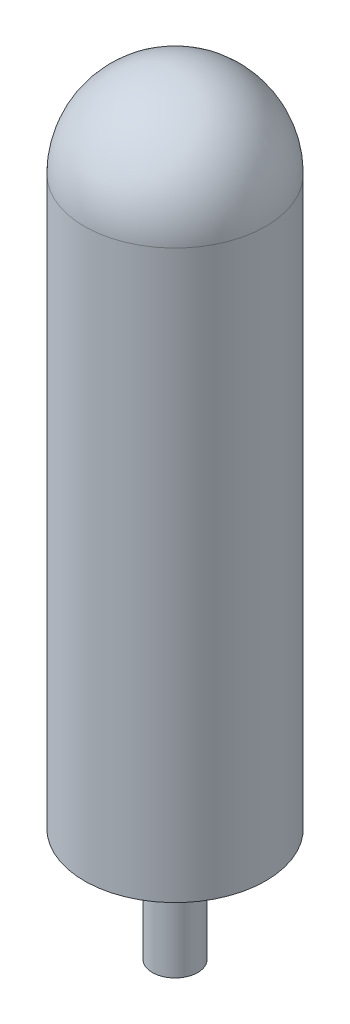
from build123d import *


with BuildPart() as part:
    # Sketch1 → Revolve1 (revolve)
    with BuildSketch(Plane.XY):
        with BuildLine():
            Line((0, 0), (2, 0))
            Line((2, 0), (2, 10))
            Line((2, 10), (8, 10))
            Line((8, 10), (8, 60))
            ThreePointArc((8, 60), (5.656854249, 65.656854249), (0, 68))
            Line((0, 68), (0, 0))
        make_face()
    revolve(axis=Axis((0, 0, 0), (0, 1, 0)))


solid = part.part
